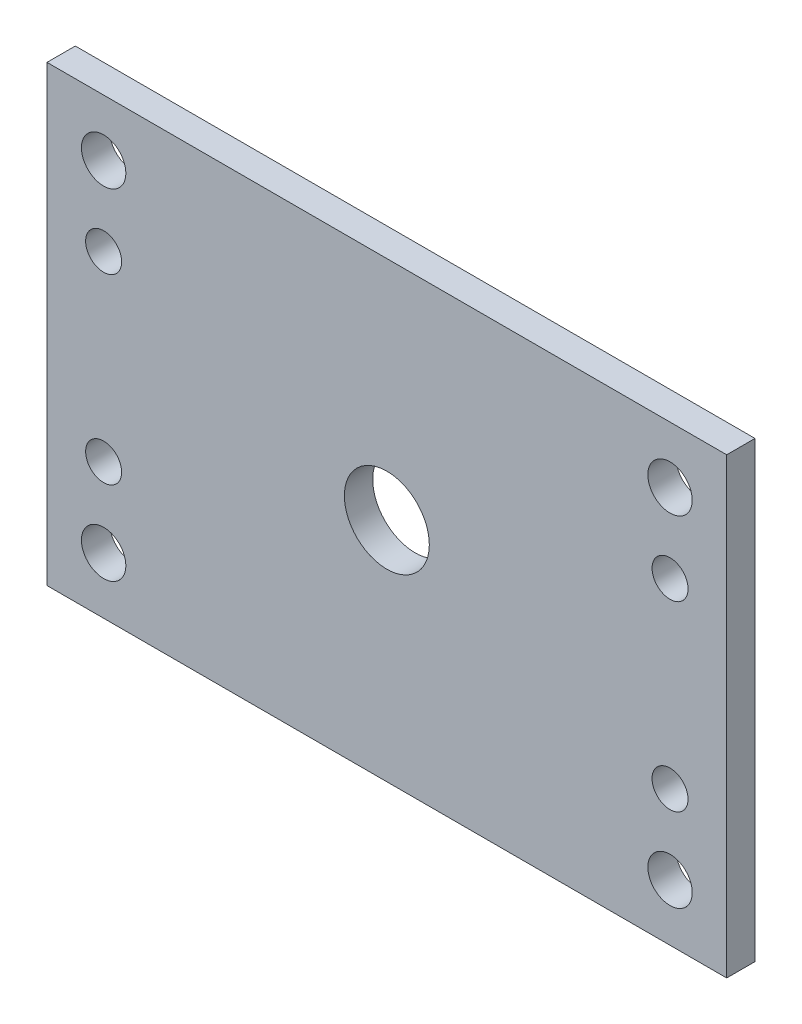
ISO-10303-21;
HEADER;
FILE_DESCRIPTION(('STEP AP214'),'2;1');
FILE_NAME('part.step','',(''),(''),'','','');
FILE_SCHEMA(('AUTOMOTIVE_DESIGN { 1 0 10303 214 1 1 1 1 }'));
ENDSEC;
DATA;
#1=APPLICATION_CONTEXT('core data for automotive mechanical design processes');
#2=APPLICATION_PROTOCOL_DEFINITION('international standard','automotive_design',2000,#1);
#3=PRODUCT_CONTEXT('',#1,'mechanical');
#4=PRODUCT('Part','Part','',(#3));
#5=PRODUCT_RELATED_PRODUCT_CATEGORY('part','',(#4));
#6=PRODUCT_DEFINITION_FORMATION('','',#4);
#7=PRODUCT_DEFINITION_CONTEXT('part definition',#1,'design');
#8=PRODUCT_DEFINITION('design','',#6,#7);
#9=PRODUCT_DEFINITION_SHAPE('','',#8);
#10=(LENGTH_UNIT() NAMED_UNIT(*) SI_UNIT(.MILLI.,.METRE.));
#11=(NAMED_UNIT(*) PLANE_ANGLE_UNIT() SI_UNIT($,.RADIAN.));
#12=(NAMED_UNIT(*) SI_UNIT($,.STERADIAN.) SOLID_ANGLE_UNIT());
#13=UNCERTAINTY_MEASURE_WITH_UNIT(LENGTH_MEASURE(1.E-05),#10,'distance_accuracy_value','');
#14=(GEOMETRIC_REPRESENTATION_CONTEXT(3) GLOBAL_UNCERTAINTY_ASSIGNED_CONTEXT((#13)) GLOBAL_UNIT_ASSIGNED_CONTEXT((#10,
#11,#12)) REPRESENTATION_CONTEXT('',''));
#15=CARTESIAN_POINT('',(0.,0.,0.));
#16=DIRECTION('',(0.,0.,1.));
#17=DIRECTION('',(1.,0.,0.));
#18=AXIS2_PLACEMENT_3D('',#15,#16,#17);
#19=CARTESIAN_POINT('',(0.,0.,3.175));
#20=DIRECTION('',(0.,0.,-1.));
#21=DIRECTION('',(-1.,0.,0.));
#22=AXIS2_PLACEMENT_3D('',#19,#20,#21);
#23=PLANE('',#22);
#24=DIRECTION('',(0.,-1.,0.));
#25=VECTOR('',#24,1.);
#26=CARTESIAN_POINT('',(0.,0.,3.175));
#27=LINE('',#26,#25);
#28=CARTESIAN_POINT('',(0.,50.8,3.175));
#29=VERTEX_POINT('',#28);
#30=CARTESIAN_POINT('',(0.,0.,3.175));
#31=VERTEX_POINT('',#30);
#32=EDGE_CURVE('E88',#29,#31,#27,.T.);
#33=ORIENTED_EDGE('',*,*,#32,.T.);
#34=DIRECTION('',(1.,0.,0.));
#35=VECTOR('',#34,1.);
#36=CARTESIAN_POINT('',(0.,0.,3.175));
#37=LINE('',#36,#35);
#38=CARTESIAN_POINT('',(76.2,0.,3.175));
#39=VERTEX_POINT('',#38);
#40=EDGE_CURVE('E83',#31,#39,#37,.T.);
#41=ORIENTED_EDGE('',*,*,#40,.T.);
#42=DIRECTION('',(0.,1.,0.));
#43=VECTOR('',#42,1.);
#44=CARTESIAN_POINT('',(76.2,0.,3.175));
#45=LINE('',#44,#43);
#46=CARTESIAN_POINT('',(76.2,50.8,3.175));
#47=VERTEX_POINT('',#46);
#48=EDGE_CURVE('E86',#39,#47,#45,.T.);
#49=ORIENTED_EDGE('',*,*,#48,.T.);
#50=DIRECTION('',(-1.,0.,0.));
#51=VECTOR('',#50,1.);
#52=CARTESIAN_POINT('',(0.,50.8,3.175));
#53=LINE('',#52,#51);
#54=EDGE_CURVE('E53',#47,#29,#53,.T.);
#55=ORIENTED_EDGE('',*,*,#54,.T.);
#56=EDGE_LOOP('',(#33,#41,#49,#55));
#57=FACE_BOUND('',#56,.T.);
#58=CARTESIAN_POINT('',(6.35,44.45,3.175));
#59=DIRECTION('',(0.,0.,1.));
#60=DIRECTION('',(1.,0.,0.));
#61=AXIS2_PLACEMENT_3D('',#58,#59,#60);
#62=CIRCLE('',#61,2.4892);
#63=CARTESIAN_POINT('',(8.8392,44.45,3.175));
#64=VERTEX_POINT('',#63);
#65=EDGE_CURVE('E103',#64,#64,#62,.T.);
#66=ORIENTED_EDGE('',*,*,#65,.F.);
#67=EDGE_LOOP('',(#66));
#68=FACE_BOUND('',#67,.T.);
#69=CARTESIAN_POINT('',(69.85,44.45,3.175));
#70=DIRECTION('',(0.,0.,1.));
#71=DIRECTION('',(1.,0.,0.));
#72=AXIS2_PLACEMENT_3D('',#69,#70,#71);
#73=CIRCLE('',#72,2.48920000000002);
#74=CARTESIAN_POINT('',(72.3392,44.45,3.175));
#75=VERTEX_POINT('',#74);
#76=EDGE_CURVE('E118',#75,#75,#73,.T.);
#77=ORIENTED_EDGE('',*,*,#76,.F.);
#78=EDGE_LOOP('',(#77));
#79=FACE_BOUND('',#78,.T.);
#80=CARTESIAN_POINT('',(69.85,6.35,3.175));
#81=DIRECTION('',(0.,0.,1.));
#82=DIRECTION('',(1.,0.,0.));
#83=AXIS2_PLACEMENT_3D('',#80,#81,#82);
#84=CIRCLE('',#83,2.4892);
#85=CARTESIAN_POINT('',(72.3392,6.35,3.175));
#86=VERTEX_POINT('',#85);
#87=EDGE_CURVE('E124',#86,#86,#84,.T.);
#88=ORIENTED_EDGE('',*,*,#87,.F.);
#89=EDGE_LOOP('',(#88));
#90=FACE_BOUND('',#89,.T.);
#91=CARTESIAN_POINT('',(6.35,6.35,3.175));
#92=DIRECTION('',(0.,0.,1.));
#93=DIRECTION('',(1.,0.,0.));
#94=AXIS2_PLACEMENT_3D('',#91,#92,#93);
#95=CIRCLE('',#94,2.4892);
#96=CARTESIAN_POINT('',(8.8392,6.35,3.175));
#97=VERTEX_POINT('',#96);
#98=EDGE_CURVE('E130',#97,#97,#95,.T.);
#99=ORIENTED_EDGE('',*,*,#98,.F.);
#100=EDGE_LOOP('',(#99));
#101=FACE_BOUND('',#100,.T.);
#102=CARTESIAN_POINT('',(38.1,25.4,3.175));
#103=DIRECTION('',(0.,0.,1.));
#104=DIRECTION('',(1.,0.,0.));
#105=AXIS2_PLACEMENT_3D('',#102,#103,#104);
#106=CIRCLE('',#105,4.7625);
#107=CARTESIAN_POINT('',(42.8625,25.4,3.175));
#108=VERTEX_POINT('',#107);
#109=EDGE_CURVE('E136',#108,#108,#106,.T.);
#110=ORIENTED_EDGE('',*,*,#109,.F.);
#111=EDGE_LOOP('',(#110));
#112=FACE_BOUND('',#111,.T.);
#113=CARTESIAN_POINT('',(6.35,35.6108,3.175));
#114=DIRECTION('',(0.,0.,1.));
#115=DIRECTION('',(1.,0.,0.));
#116=AXIS2_PLACEMENT_3D('',#113,#114,#115);
#117=CIRCLE('',#116,2.0193);
#118=CARTESIAN_POINT('',(8.3693,35.6108,3.175));
#119=VERTEX_POINT('',#118);
#120=EDGE_CURVE('E142',#119,#119,#117,.T.);
#121=ORIENTED_EDGE('',*,*,#120,.F.);
#122=EDGE_LOOP('',(#121));
#123=FACE_BOUND('',#122,.T.);
#124=CARTESIAN_POINT('',(6.35,15.1892,3.175));
#125=DIRECTION('',(0.,0.,1.));
#126=DIRECTION('',(1.,0.,0.));
#127=AXIS2_PLACEMENT_3D('',#124,#125,#126);
#128=CIRCLE('',#127,2.0193);
#129=CARTESIAN_POINT('',(8.3693,15.1892,3.175));
#130=VERTEX_POINT('',#129);
#131=EDGE_CURVE('E148',#130,#130,#128,.T.);
#132=ORIENTED_EDGE('',*,*,#131,.F.);
#133=EDGE_LOOP('',(#132));
#134=FACE_BOUND('',#133,.T.);
#135=CARTESIAN_POINT('',(69.85,15.1892,3.175));
#136=DIRECTION('',(0.,0.,1.));
#137=DIRECTION('',(1.,0.,0.));
#138=AXIS2_PLACEMENT_3D('',#135,#136,#137);
#139=CIRCLE('',#138,2.01930000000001);
#140=CARTESIAN_POINT('',(71.8693,15.1892,3.175));
#141=VERTEX_POINT('',#140);
#142=EDGE_CURVE('E154',#141,#141,#139,.T.);
#143=ORIENTED_EDGE('',*,*,#142,.F.);
#144=EDGE_LOOP('',(#143));
#145=FACE_BOUND('',#144,.T.);
#146=CARTESIAN_POINT('',(69.85,35.6108,3.175));
#147=DIRECTION('',(0.,0.,1.));
#148=DIRECTION('',(1.,0.,0.));
#149=AXIS2_PLACEMENT_3D('',#146,#147,#148);
#150=CIRCLE('',#149,2.01930000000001);
#151=CARTESIAN_POINT('',(71.8693,35.6108,3.175));
#152=VERTEX_POINT('',#151);
#153=EDGE_CURVE('E160',#152,#152,#150,.T.);
#154=ORIENTED_EDGE('',*,*,#153,.F.);
#155=EDGE_LOOP('',(#154));
#156=FACE_BOUND('',#155,.T.);
#157=ADVANCED_FACE('F36',(#57,#68,#79,#90,#101,#112,#123,#134,#145,#156),#23,.F.);
#158=CARTESIAN_POINT('',(0.,0.,0.));
#159=DIRECTION('',(0.,0.,-1.));
#160=DIRECTION('',(-1.,0.,0.));
#161=AXIS2_PLACEMENT_3D('',#158,#159,#160);
#162=PLANE('',#161);
#163=CARTESIAN_POINT('',(69.85,15.1892,0.));
#164=DIRECTION('',(0.,0.,1.));
#165=DIRECTION('',(1.,0.,0.));
#166=AXIS2_PLACEMENT_3D('',#163,#164,#165);
#167=CIRCLE('',#166,2.01930000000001);
#168=CARTESIAN_POINT('',(71.8693,15.1892,0.));
#169=VERTEX_POINT('',#168);
#170=EDGE_CURVE('E157',#169,#169,#167,.T.);
#171=ORIENTED_EDGE('',*,*,#170,.T.);
#172=EDGE_LOOP('',(#171));
#173=FACE_BOUND('',#172,.T.);
#174=CARTESIAN_POINT('',(6.35,35.6108,0.));
#175=DIRECTION('',(0.,0.,1.));
#176=DIRECTION('',(1.,0.,0.));
#177=AXIS2_PLACEMENT_3D('',#174,#175,#176);
#178=CIRCLE('',#177,2.0193);
#179=CARTESIAN_POINT('',(8.3693,35.6108,0.));
#180=VERTEX_POINT('',#179);
#181=EDGE_CURVE('E145',#180,#180,#178,.T.);
#182=ORIENTED_EDGE('',*,*,#181,.T.);
#183=EDGE_LOOP('',(#182));
#184=FACE_BOUND('',#183,.T.);
#185=CARTESIAN_POINT('',(6.35,6.35,0.));
#186=DIRECTION('',(0.,0.,1.));
#187=DIRECTION('',(1.,0.,0.));
#188=AXIS2_PLACEMENT_3D('',#185,#186,#187);
#189=CIRCLE('',#188,2.4892);
#190=CARTESIAN_POINT('',(8.8392,6.35,0.));
#191=VERTEX_POINT('',#190);
#192=EDGE_CURVE('E133',#191,#191,#189,.T.);
#193=ORIENTED_EDGE('',*,*,#192,.T.);
#194=EDGE_LOOP('',(#193));
#195=FACE_BOUND('',#194,.T.);
#196=CARTESIAN_POINT('',(69.85,44.45,0.));
#197=DIRECTION('',(0.,0.,1.));
#198=DIRECTION('',(1.,0.,0.));
#199=AXIS2_PLACEMENT_3D('',#196,#197,#198);
#200=CIRCLE('',#199,2.48920000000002);
#201=CARTESIAN_POINT('',(72.3392,44.45,0.));
#202=VERTEX_POINT('',#201);
#203=EDGE_CURVE('E121',#202,#202,#200,.T.);
#204=ORIENTED_EDGE('',*,*,#203,.T.);
#205=EDGE_LOOP('',(#204));
#206=FACE_BOUND('',#205,.T.);
#207=DIRECTION('',(0.,-1.,0.));
#208=VECTOR('',#207,1.);
#209=CARTESIAN_POINT('',(0.,0.,0.));
#210=LINE('',#209,#208);
#211=CARTESIAN_POINT('',(0.,50.8,0.));
#212=VERTEX_POINT('',#211);
#213=CARTESIAN_POINT('',(0.,0.,0.));
#214=VERTEX_POINT('',#213);
#215=EDGE_CURVE('E100',#212,#214,#210,.T.);
#216=ORIENTED_EDGE('',*,*,#215,.F.);
#217=DIRECTION('',(-1.,0.,0.));
#218=VECTOR('',#217,1.);
#219=CARTESIAN_POINT('',(0.,50.8,0.));
#220=LINE('',#219,#218);
#221=CARTESIAN_POINT('',(76.2,50.8,0.));
#222=VERTEX_POINT('',#221);
#223=EDGE_CURVE('E76',#222,#212,#220,.T.);
#224=ORIENTED_EDGE('',*,*,#223,.F.);
#225=DIRECTION('',(0.,1.,0.));
#226=VECTOR('',#225,1.);
#227=CARTESIAN_POINT('',(76.2,0.,0.));
#228=LINE('',#227,#226);
#229=CARTESIAN_POINT('',(76.2,0.,0.));
#230=VERTEX_POINT('',#229);
#231=EDGE_CURVE('E70',#230,#222,#228,.T.);
#232=ORIENTED_EDGE('',*,*,#231,.F.);
#233=DIRECTION('',(1.,0.,0.));
#234=VECTOR('',#233,1.);
#235=CARTESIAN_POINT('',(0.,0.,0.));
#236=LINE('',#235,#234);
#237=EDGE_CURVE('E92',#214,#230,#236,.T.);
#238=ORIENTED_EDGE('',*,*,#237,.F.);
#239=EDGE_LOOP('',(#216,#224,#232,#238));
#240=FACE_BOUND('',#239,.T.);
#241=CARTESIAN_POINT('',(6.35,44.45,0.));
#242=DIRECTION('',(0.,0.,1.));
#243=DIRECTION('',(1.,0.,0.));
#244=AXIS2_PLACEMENT_3D('',#241,#242,#243);
#245=CIRCLE('',#244,2.4892);
#246=CARTESIAN_POINT('',(8.8392,44.45,0.));
#247=VERTEX_POINT('',#246);
#248=EDGE_CURVE('E115',#247,#247,#245,.T.);
#249=ORIENTED_EDGE('',*,*,#248,.T.);
#250=EDGE_LOOP('',(#249));
#251=FACE_BOUND('',#250,.T.);
#252=CARTESIAN_POINT('',(69.85,6.35,0.));
#253=DIRECTION('',(0.,0.,1.));
#254=DIRECTION('',(1.,0.,0.));
#255=AXIS2_PLACEMENT_3D('',#252,#253,#254);
#256=CIRCLE('',#255,2.4892);
#257=CARTESIAN_POINT('',(72.3392,6.35,0.));
#258=VERTEX_POINT('',#257);
#259=EDGE_CURVE('E127',#258,#258,#256,.T.);
#260=ORIENTED_EDGE('',*,*,#259,.T.);
#261=EDGE_LOOP('',(#260));
#262=FACE_BOUND('',#261,.T.);
#263=CARTESIAN_POINT('',(38.1,25.4,0.));
#264=DIRECTION('',(0.,0.,1.));
#265=DIRECTION('',(1.,0.,0.));
#266=AXIS2_PLACEMENT_3D('',#263,#264,#265);
#267=CIRCLE('',#266,4.7625);
#268=CARTESIAN_POINT('',(42.8625,25.4,0.));
#269=VERTEX_POINT('',#268);
#270=EDGE_CURVE('E139',#269,#269,#267,.T.);
#271=ORIENTED_EDGE('',*,*,#270,.T.);
#272=EDGE_LOOP('',(#271));
#273=FACE_BOUND('',#272,.T.);
#274=CARTESIAN_POINT('',(6.35,15.1892,0.));
#275=DIRECTION('',(0.,0.,1.));
#276=DIRECTION('',(1.,0.,0.));
#277=AXIS2_PLACEMENT_3D('',#274,#275,#276);
#278=CIRCLE('',#277,2.0193);
#279=CARTESIAN_POINT('',(8.3693,15.1892,0.));
#280=VERTEX_POINT('',#279);
#281=EDGE_CURVE('E151',#280,#280,#278,.T.);
#282=ORIENTED_EDGE('',*,*,#281,.T.);
#283=EDGE_LOOP('',(#282));
#284=FACE_BOUND('',#283,.T.);
#285=CARTESIAN_POINT('',(69.85,35.6108,0.));
#286=DIRECTION('',(0.,0.,1.));
#287=DIRECTION('',(1.,0.,0.));
#288=AXIS2_PLACEMENT_3D('',#285,#286,#287);
#289=CIRCLE('',#288,2.01930000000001);
#290=CARTESIAN_POINT('',(71.8693,35.6108,0.));
#291=VERTEX_POINT('',#290);
#292=EDGE_CURVE('E163',#291,#291,#289,.T.);
#293=ORIENTED_EDGE('',*,*,#292,.T.);
#294=EDGE_LOOP('',(#293));
#295=FACE_BOUND('',#294,.T.);
#296=ADVANCED_FACE('F111',(#173,#184,#195,#206,#240,#251,#262,#273,#284,#295),#162,.T.);
#297=CARTESIAN_POINT('',(0.,0.,3.175));
#298=DIRECTION('',(1.,0.,0.));
#299=DIRECTION('',(0.,0.,-1.));
#300=AXIS2_PLACEMENT_3D('',#297,#298,#299);
#301=PLANE('',#300);
#302=ORIENTED_EDGE('',*,*,#215,.T.);
#303=DIRECTION('',(0.,0.,-1.));
#304=VECTOR('',#303,1.);
#305=CARTESIAN_POINT('',(0.,0.,3.175));
#306=LINE('',#305,#304);
#307=EDGE_CURVE('E11',#31,#214,#306,.T.);
#308=ORIENTED_EDGE('',*,*,#307,.F.);
#309=ORIENTED_EDGE('',*,*,#32,.F.);
#310=DIRECTION('',(0.,0.,-1.));
#311=VECTOR('',#310,1.);
#312=CARTESIAN_POINT('',(0.,50.8,3.175));
#313=LINE('',#312,#311);
#314=EDGE_CURVE('E96',#29,#212,#313,.T.);
#315=ORIENTED_EDGE('',*,*,#314,.T.);
#316=EDGE_LOOP('',(#302,#308,#309,#315));
#317=FACE_BOUND('',#316,.T.);
#318=ADVANCED_FACE('F38',(#317),#301,.F.);
#319=CARTESIAN_POINT('',(0.,0.,3.175));
#320=DIRECTION('',(0.,1.,0.));
#321=DIRECTION('',(0.,0.,1.));
#322=AXIS2_PLACEMENT_3D('',#319,#320,#321);
#323=PLANE('',#322);
#324=ORIENTED_EDGE('',*,*,#237,.T.);
#325=DIRECTION('',(0.,0.,-1.));
#326=VECTOR('',#325,1.);
#327=CARTESIAN_POINT('',(76.2,0.,3.175));
#328=LINE('',#327,#326);
#329=EDGE_CURVE('E45',#39,#230,#328,.T.);
#330=ORIENTED_EDGE('',*,*,#329,.F.);
#331=ORIENTED_EDGE('',*,*,#40,.F.);
#332=ORIENTED_EDGE('',*,*,#307,.T.);
#333=EDGE_LOOP('',(#324,#330,#331,#332));
#334=FACE_BOUND('',#333,.T.);
#335=ADVANCED_FACE('F91',(#334),#323,.F.);
#336=CARTESIAN_POINT('',(76.2,0.,3.175));
#337=DIRECTION('',(-1.,0.,0.));
#338=DIRECTION('',(0.,0.,1.));
#339=AXIS2_PLACEMENT_3D('',#336,#337,#338);
#340=PLANE('',#339);
#341=ORIENTED_EDGE('',*,*,#231,.T.);
#342=DIRECTION('',(0.,0.,-1.));
#343=VECTOR('',#342,1.);
#344=CARTESIAN_POINT('',(76.2,50.8,3.175));
#345=LINE('',#344,#343);
#346=EDGE_CURVE('E93',#47,#222,#345,.T.);
#347=ORIENTED_EDGE('',*,*,#346,.F.);
#348=ORIENTED_EDGE('',*,*,#48,.F.);
#349=ORIENTED_EDGE('',*,*,#329,.T.);
#350=EDGE_LOOP('',(#341,#347,#348,#349));
#351=FACE_BOUND('',#350,.T.);
#352=ADVANCED_FACE('F94',(#351),#340,.F.);
#353=CARTESIAN_POINT('',(0.,50.8,3.175));
#354=DIRECTION('',(0.,-1.,0.));
#355=DIRECTION('',(0.,0.,-1.));
#356=AXIS2_PLACEMENT_3D('',#353,#354,#355);
#357=PLANE('',#356);
#358=ORIENTED_EDGE('',*,*,#223,.T.);
#359=ORIENTED_EDGE('',*,*,#314,.F.);
#360=ORIENTED_EDGE('',*,*,#54,.F.);
#361=ORIENTED_EDGE('',*,*,#346,.T.);
#362=EDGE_LOOP('',(#358,#359,#360,#361));
#363=FACE_BOUND('',#362,.T.);
#364=ADVANCED_FACE('F108',(#363),#357,.F.);
#365=CARTESIAN_POINT('',(6.35,44.45,3.175));
#366=DIRECTION('',(0.,0.,-1.));
#367=DIRECTION('',(-1.,0.,0.));
#368=AXIS2_PLACEMENT_3D('',#365,#366,#367);
#369=CYLINDRICAL_SURFACE('',#368,2.4892);
#370=ORIENTED_EDGE('',*,*,#65,.T.);
#371=EDGE_LOOP('',(#370));
#372=FACE_BOUND('',#371,.T.);
#373=ORIENTED_EDGE('',*,*,#248,.F.);
#374=EDGE_LOOP('',(#373));
#375=FACE_BOUND('',#374,.T.);
#376=ADVANCED_FACE('F180',(#372,#375),#369,.F.);
#377=CARTESIAN_POINT('',(69.85,44.45,3.175));
#378=DIRECTION('',(0.,0.,-1.));
#379=DIRECTION('',(-1.,0.,0.));
#380=AXIS2_PLACEMENT_3D('',#377,#378,#379);
#381=CYLINDRICAL_SURFACE('',#380,2.48920000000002);
#382=ORIENTED_EDGE('',*,*,#76,.T.);
#383=EDGE_LOOP('',(#382));
#384=FACE_BOUND('',#383,.T.);
#385=ORIENTED_EDGE('',*,*,#203,.F.);
#386=EDGE_LOOP('',(#385));
#387=FACE_BOUND('',#386,.T.);
#388=ADVANCED_FACE('F226',(#384,#387),#381,.F.);
#389=CARTESIAN_POINT('',(69.85,6.35,3.175));
#390=DIRECTION('',(0.,0.,-1.));
#391=DIRECTION('',(-1.,0.,0.));
#392=AXIS2_PLACEMENT_3D('',#389,#390,#391);
#393=CYLINDRICAL_SURFACE('',#392,2.4892);
#394=ORIENTED_EDGE('',*,*,#87,.T.);
#395=EDGE_LOOP('',(#394));
#396=FACE_BOUND('',#395,.T.);
#397=ORIENTED_EDGE('',*,*,#259,.F.);
#398=EDGE_LOOP('',(#397));
#399=FACE_BOUND('',#398,.T.);
#400=ADVANCED_FACE('F234',(#396,#399),#393,.F.);
#401=CARTESIAN_POINT('',(6.35,6.35,3.175));
#402=DIRECTION('',(0.,0.,-1.));
#403=DIRECTION('',(-1.,0.,0.));
#404=AXIS2_PLACEMENT_3D('',#401,#402,#403);
#405=CYLINDRICAL_SURFACE('',#404,2.4892);
#406=ORIENTED_EDGE('',*,*,#98,.T.);
#407=EDGE_LOOP('',(#406));
#408=FACE_BOUND('',#407,.T.);
#409=ORIENTED_EDGE('',*,*,#192,.F.);
#410=EDGE_LOOP('',(#409));
#411=FACE_BOUND('',#410,.T.);
#412=ADVANCED_FACE('F242',(#408,#411),#405,.F.);
#413=CARTESIAN_POINT('',(38.1,25.4,3.175));
#414=DIRECTION('',(0.,0.,-1.));
#415=DIRECTION('',(-1.,0.,0.));
#416=AXIS2_PLACEMENT_3D('',#413,#414,#415);
#417=CYLINDRICAL_SURFACE('',#416,4.7625);
#418=ORIENTED_EDGE('',*,*,#109,.T.);
#419=EDGE_LOOP('',(#418));
#420=FACE_BOUND('',#419,.T.);
#421=ORIENTED_EDGE('',*,*,#270,.F.);
#422=EDGE_LOOP('',(#421));
#423=FACE_BOUND('',#422,.T.);
#424=ADVANCED_FACE('F251',(#420,#423),#417,.F.);
#425=CARTESIAN_POINT('',(6.35,35.6108,3.175));
#426=DIRECTION('',(0.,0.,-1.));
#427=DIRECTION('',(-1.,0.,0.));
#428=AXIS2_PLACEMENT_3D('',#425,#426,#427);
#429=CYLINDRICAL_SURFACE('',#428,2.0193);
#430=ORIENTED_EDGE('',*,*,#120,.T.);
#431=EDGE_LOOP('',(#430));
#432=FACE_BOUND('',#431,.T.);
#433=ORIENTED_EDGE('',*,*,#181,.F.);
#434=EDGE_LOOP('',(#433));
#435=FACE_BOUND('',#434,.T.);
#436=ADVANCED_FACE('F260',(#432,#435),#429,.F.);
#437=CARTESIAN_POINT('',(6.35,15.1892,3.175));
#438=DIRECTION('',(0.,0.,-1.));
#439=DIRECTION('',(-1.,0.,0.));
#440=AXIS2_PLACEMENT_3D('',#437,#438,#439);
#441=CYLINDRICAL_SURFACE('',#440,2.0193);
#442=ORIENTED_EDGE('',*,*,#131,.T.);
#443=EDGE_LOOP('',(#442));
#444=FACE_BOUND('',#443,.T.);
#445=ORIENTED_EDGE('',*,*,#281,.F.);
#446=EDGE_LOOP('',(#445));
#447=FACE_BOUND('',#446,.T.);
#448=ADVANCED_FACE('F269',(#444,#447),#441,.F.);
#449=CARTESIAN_POINT('',(69.85,15.1892,3.175));
#450=DIRECTION('',(0.,0.,-1.));
#451=DIRECTION('',(-1.,0.,0.));
#452=AXIS2_PLACEMENT_3D('',#449,#450,#451);
#453=CYLINDRICAL_SURFACE('',#452,2.01930000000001);
#454=ORIENTED_EDGE('',*,*,#142,.T.);
#455=EDGE_LOOP('',(#454));
#456=FACE_BOUND('',#455,.T.);
#457=ORIENTED_EDGE('',*,*,#170,.F.);
#458=EDGE_LOOP('',(#457));
#459=FACE_BOUND('',#458,.T.);
#460=ADVANCED_FACE('F278',(#456,#459),#453,.F.);
#461=CARTESIAN_POINT('',(69.85,35.6108,3.175));
#462=DIRECTION('',(0.,0.,-1.));
#463=DIRECTION('',(-1.,0.,0.));
#464=AXIS2_PLACEMENT_3D('',#461,#462,#463);
#465=CYLINDRICAL_SURFACE('',#464,2.01930000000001);
#466=ORIENTED_EDGE('',*,*,#153,.T.);
#467=EDGE_LOOP('',(#466));
#468=FACE_BOUND('',#467,.T.);
#469=ORIENTED_EDGE('',*,*,#292,.F.);
#470=EDGE_LOOP('',(#469));
#471=FACE_BOUND('',#470,.T.);
#472=ADVANCED_FACE('F169',(#468,#471),#465,.F.);
#473=CLOSED_SHELL('',(#157,#296,#318,#335,#352,#364,#376,#388,#400,#412,#424,#436,#448,#460,#472));
#474=MANIFOLD_SOLID_BREP('B2',#473);
#475=ADVANCED_BREP_SHAPE_REPRESENTATION('',(#18,#474),#14);
#476=SHAPE_DEFINITION_REPRESENTATION(#9,#475);
ENDSEC;
END-ISO-10303-21;
